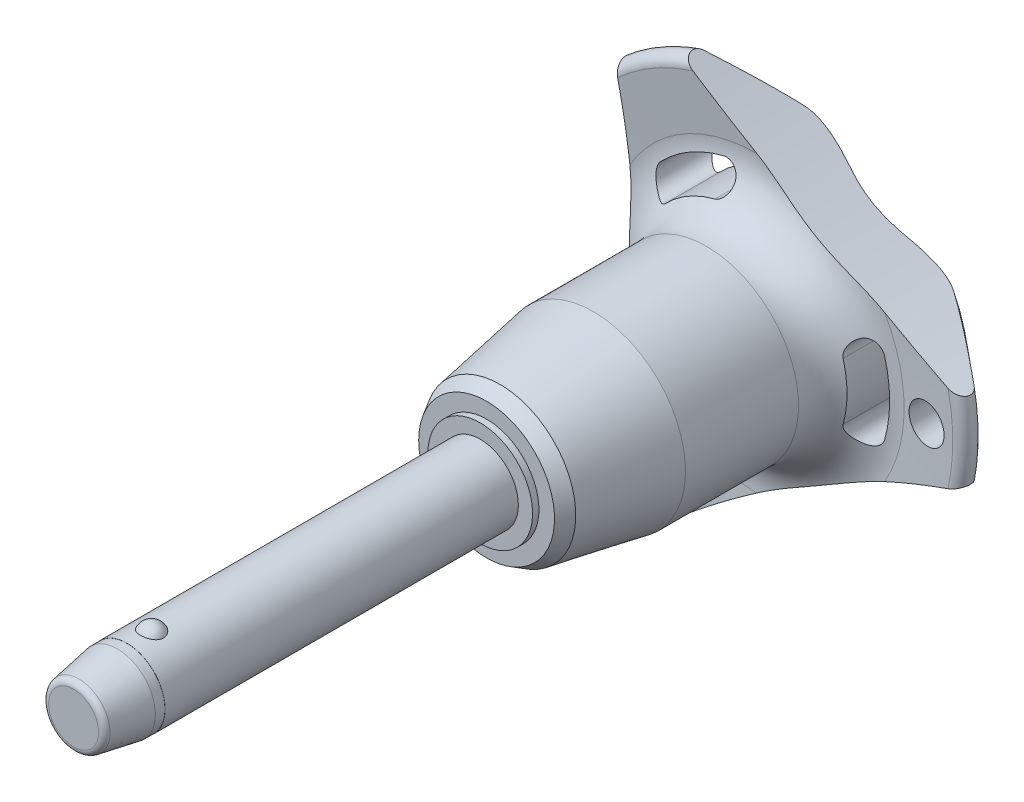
from build123d import *

# Parameters (mm, degrees)
SKETCH1_R           = 3
BOSS_EXTRUDE1_DEPTH = 25
SKETCH2_R           = 2.5
BOSS_EXTRUDE2_DEPTH = 26.7
BOSS_EXTRUDE3_START = 7
SKETCH1_2_R         = 3
BOSS_EXTRUDE3_DEPTH = 7
CHAMFER1_SIZE       = 3.5
CHAMFER1_SIZE2      = 0.617144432
FILLET1_R           = 0.5
SKETCH6_R           = 79.96
CUT_EXTRUDE1_DEPTH  = 57.781042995
CIRPATTERN1_COUNT   = 3
SKETCH7_R           = 1.5
CUT_EXTRUDE2_DEPTH  = 57.512343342
SKETCH8_R           = 3
SKETCH8_R_2         = 2.99
CUT_EXTRUDE3_DEPTH  = 4.2


with BuildPart() as part:
    # Sketch1 → Boss-Extrude1 (new body)
    with BuildSketch(Plane.XY):
        Circle(SKETCH1_R)
    extrude(amount=-BOSS_EXTRUDE1_DEPTH)

    # Sketch2 → Boss-Extrude2 (add)
    with BuildSketch(Plane(origin=(0, 0, -25), x_dir=(-1, 0, 0), z_dir=(0, 0, -1))):
        Circle(SKETCH2_R)
    extrude(amount=BOSS_EXTRUDE2_DEPTH)

    # Sketch3 → Revolve1 (revolve)
    with BuildSketch(Plane(origin=(0, 0, 0), x_dir=(0, 0, -1), z_dir=(1, 0, 0))):
        with BuildLine():
            Line((-0.866025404, 3.5), (-0.866025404, 1.5))
            ThreePointArc((-0.866025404, 1.5), (0.133974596, 2.5), (-0.866025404, 3.5))
        make_face()
        with BuildLine():
            Line((-0.866025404, -1.5), (-0.866025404, -3.5))
            ThreePointArc((-0.866025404, -3.5), (0.133974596, -2.5), (-0.866025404, -1.5))
        make_face()
    revolve(axis=Axis((0, -1.5, 0.866025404), (0, 1, 0)))

    # Sketch1_2 → Boss-Extrude3 (add)
    with BuildSketch(Plane.XY.offset(BOSS_EXTRUDE3_START)):
        Circle(SKETCH1_2_R)
    extrude(amount=-BOSS_EXTRUDE3_DEPTH)

    # Chamfer1
    chamfer1_edges = [part.edges().sort_by_distance(p)[0] for p in [
        (-3, 0, 7),
    ]]
    chamfer1_side = [part.faces().sort_by_distance(p)[0] for p in [
        (-3, 0, -9),
    ]]
    chamfer(chamfer1_edges, length=CHAMFER1_SIZE, length2=CHAMFER1_SIZE2, reference=chamfer1_side[0])

    # Fillet1
    fillet1_edges = [part.edges().sort_by_distance(p)[0] for p in [
        (-2.382855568, 0, 7),
        (2.5, 0, -51.7),
    ]]
    fillet(fillet1_edges, radius=FILLET1_R)

    # Sketch4 → Revolve2 (revolve)
    with BuildSketch(Plane(origin=(0, 0, 0), x_dir=(0, 0, -1), z_dir=(1, 0, 0)), mode=Mode.PRIVATE) as revolve2_sk:
        Polygon((25, 0), (25, 4.118359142), (25.5, 4.118359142), (25.5, 5.343400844), (26.560917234, 5.955921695), (33.9, 7.25), (42.8, 7.25), (42.8, 0), align=None)
    revolve(revolve2_sk.sketch.rotate(Axis((0, 0, -42.8), (0, 0, 1)), 90), axis=Axis((0, 0, -42.8), (0, 0, 1)))

    # Sketch5 → Revolve3 (revolve)
    with BuildSketch(Plane(origin=(0, 0, 0), x_dir=(0, 0, -1), z_dir=(1, 0, 0)), mode=Mode.PRIVATE) as revolve3_sk:
        with BuildLine():
            Line((46.78715932, 11.570250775), (46.452568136, 15.735949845))
            ThreePointArc((46.452568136, 15.735949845), (46.946485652, 16.540188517), (47.862835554, 16.314230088))
            Line((47.862835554, 16.314230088), (51.326414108, 12.186497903))
            ThreePointArc((51.326414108, 12.186497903), (51.7, 11.109282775), (51.261488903, 10.056825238))
            ThreePointArc((51.261488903, 10.056825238), (48.289873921, 5.413681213), (47.25, 0))
            Line((47.25, 0), (42.8, 0))
            Line((42.8, 0), (42.8, 7.25))
            ThreePointArc((42.8, 7.25), (45.739473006, 8.537160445), (46.78715932, 11.570250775))
        make_face()
    revolve(revolve3_sk.sketch.rotate(Axis((0, 0, -47.25), (0, 0, 1)), 90), axis=Axis((0, 0, -47.25), (0, 0, 1)))

    # Sketch6 → Cut-Extrude1 (cut, through all)
    with BuildSketch(Plane.XY):
        with Locations((-89.76, 0)):
            Circle(SKETCH6_R)
        with BuildLine():
            ThreePointArc((10.099921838, -2.834717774), (10.490188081, 0), (10.099921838, 2.834717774))
            ThreePointArc((10.099921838, 2.834717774), (8.768180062, 3.582738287), (8.020159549, 2.250996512))
            ThreePointArc((8.020159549, 2.250996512), (8.330062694, 0), (8.020159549, -2.250996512))
            ThreePointArc((8.020159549, -2.250996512), (8.768180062, -3.582738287), (10.099921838, -2.834717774))
        make_face()
    cut_extrude1 = extrude(amount=-CUT_EXTRUDE1_DEPTH, mode=Mode.SUBTRACT)

    # CirPattern1: Cut-Extrude1 ×3 about axis
    cirpattern1_axis = Axis((0, 0, 0), (0, 0, 1))
    for i in range(1, CIRPATTERN1_COUNT):
        add(cut_extrude1.rotate(cirpattern1_axis, i * 360 / CIRPATTERN1_COUNT), mode=Mode.SUBTRACT)

    # Sketch7 → Cut-Extrude2 (cut, through all)
    with BuildSketch(Plane.XY):
        with Locations(Location((13.490188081, 0, 0), (0, 0, 225.221865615))):
            Circle(SKETCH7_R)
    extrude(amount=-CUT_EXTRUDE2_DEPTH, mode=Mode.SUBTRACT)

    # Sketch8 → Cut-Extrude3 (cut)
    with BuildSketch(Plane.XY.offset(7)):
        Circle(SKETCH8_R)
        Circle(SKETCH8_R_2, mode=Mode.SUBTRACT)
    extrude(amount=-CUT_EXTRUDE3_DEPTH, mode=Mode.SUBTRACT)


solid = part.part
